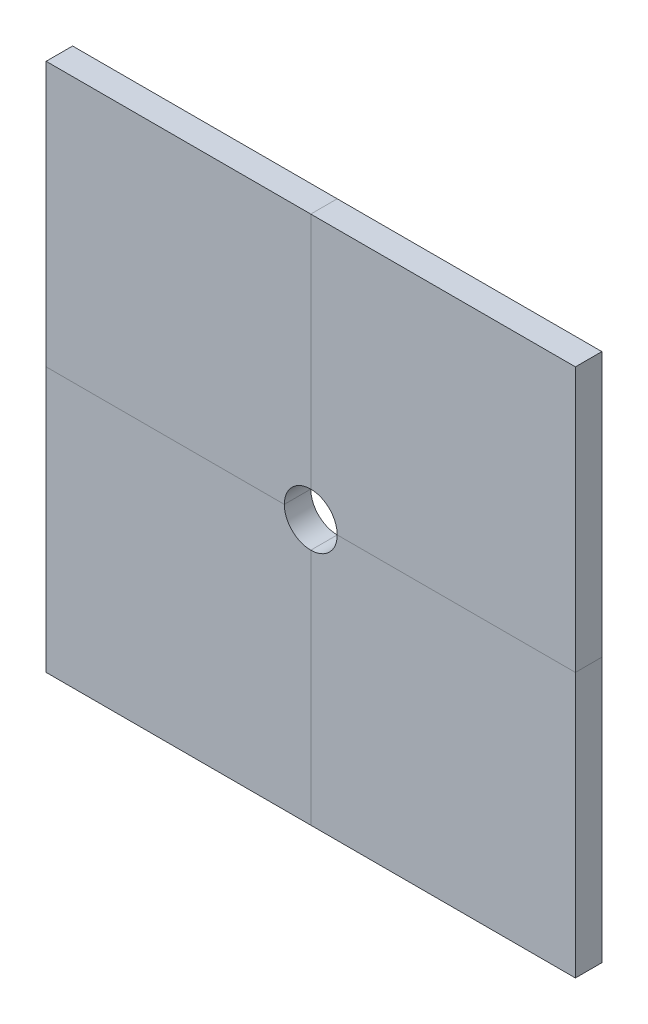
ISO-10303-21;
HEADER;
FILE_DESCRIPTION(('STEP AP214'),'2;1');
FILE_NAME('part.step','',(''),(''),'','','');
FILE_SCHEMA(('AUTOMOTIVE_DESIGN { 1 0 10303 214 1 1 1 1 }'));
ENDSEC;
DATA;
#1=APPLICATION_CONTEXT('core data for automotive mechanical design processes');
#2=APPLICATION_PROTOCOL_DEFINITION('international standard','automotive_design',2000,#1);
#3=PRODUCT_CONTEXT('',#1,'mechanical');
#4=PRODUCT('Part','Part','',(#3));
#5=PRODUCT_RELATED_PRODUCT_CATEGORY('part','',(#4));
#6=PRODUCT_DEFINITION_FORMATION('','',#4);
#7=PRODUCT_DEFINITION_CONTEXT('part definition',#1,'design');
#8=PRODUCT_DEFINITION('design','',#6,#7);
#9=PRODUCT_DEFINITION_SHAPE('','',#8);
#10=(LENGTH_UNIT() NAMED_UNIT(*) SI_UNIT(.MILLI.,.METRE.));
#11=(NAMED_UNIT(*) PLANE_ANGLE_UNIT() SI_UNIT($,.RADIAN.));
#12=(NAMED_UNIT(*) SI_UNIT($,.STERADIAN.) SOLID_ANGLE_UNIT());
#13=UNCERTAINTY_MEASURE_WITH_UNIT(LENGTH_MEASURE(1.E-05),#10,'distance_accuracy_value','');
#14=(GEOMETRIC_REPRESENTATION_CONTEXT(3) GLOBAL_UNCERTAINTY_ASSIGNED_CONTEXT((#13)) GLOBAL_UNIT_ASSIGNED_CONTEXT((#10,
#11,#12)) REPRESENTATION_CONTEXT('',''));
#15=CARTESIAN_POINT('',(0.,0.,0.));
#16=DIRECTION('',(0.,0.,1.));
#17=DIRECTION('',(1.,0.,0.));
#18=AXIS2_PLACEMENT_3D('',#15,#16,#17);
#19=CARTESIAN_POINT('',(-25.4,-177.8,25.4));
#20=DIRECTION('',(0.,0.,-1.));
#21=DIRECTION('',(1.,0.,0.));
#22=AXIS2_PLACEMENT_3D('',#19,#20,#21);
#23=CYLINDRICAL_SURFACE('',#22,25.4000000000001);
#24=CARTESIAN_POINT('',(-25.4,-177.8,0.));
#25=DIRECTION('',(0.,0.,-1.));
#26=DIRECTION('',(1.,0.,0.));
#27=AXIS2_PLACEMENT_3D('',#24,#25,#26);
#28=CIRCLE('',#27,25.4000000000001);
#29=CARTESIAN_POINT('',(-25.4,-203.2,0.));
#30=VERTEX_POINT('',#29);
#31=CARTESIAN_POINT('',(-50.8000000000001,-177.8,0.));
#32=VERTEX_POINT('',#31);
#33=EDGE_CURVE('E128',#30,#32,#28,.T.);
#34=ORIENTED_EDGE('',*,*,#33,.T.);
#35=DIRECTION('',(0.,0.,-1.));
#36=VECTOR('',#35,1.);
#37=CARTESIAN_POINT('',(-50.8000000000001,-177.8,25.4));
#38=LINE('',#37,#36);
#39=CARTESIAN_POINT('',(-50.8000000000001,-177.8,25.4));
#40=VERTEX_POINT('',#39);
#41=EDGE_CURVE('E12',#40,#32,#38,.T.);
#42=ORIENTED_EDGE('',*,*,#41,.F.);
#43=CARTESIAN_POINT('',(-25.4,-177.8,25.4));
#44=DIRECTION('',(0.,0.,-1.));
#45=DIRECTION('',(1.,0.,0.));
#46=AXIS2_PLACEMENT_3D('',#43,#44,#45);
#47=CIRCLE('',#46,25.4000000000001);
#48=CARTESIAN_POINT('',(-25.4,-203.2,25.4));
#49=VERTEX_POINT('',#48);
#50=EDGE_CURVE('E121',#49,#40,#47,.T.);
#51=ORIENTED_EDGE('',*,*,#50,.F.);
#52=DIRECTION('',(0.,0.,-1.));
#53=VECTOR('',#52,1.);
#54=CARTESIAN_POINT('',(-25.4,-203.2,25.4));
#55=LINE('',#54,#53);
#56=EDGE_CURVE('E116',#49,#30,#55,.T.);
#57=ORIENTED_EDGE('',*,*,#56,.T.);
#58=EDGE_LOOP('',(#34,#42,#51,#57));
#59=FACE_BOUND('',#58,.T.);
#60=ADVANCED_FACE('F46',(#59),#23,.F.);
#61=CARTESIAN_POINT('',(-279.4,-177.8,25.4));
#62=DIRECTION('',(0.,-1.,0.));
#63=DIRECTION('',(1.,0.,0.));
#64=AXIS2_PLACEMENT_3D('',#61,#62,#63);
#65=PLANE('',#64);
#66=DIRECTION('',(-1.,0.,0.));
#67=VECTOR('',#66,1.);
#68=CARTESIAN_POINT('',(-279.4,-177.8,0.));
#69=LINE('',#68,#67);
#70=CARTESIAN_POINT('',(-279.4,-177.8,0.));
#71=VERTEX_POINT('',#70);
#72=EDGE_CURVE('E125',#32,#71,#69,.T.);
#73=ORIENTED_EDGE('',*,*,#72,.T.);
#74=DIRECTION('',(0.,0.,-1.));
#75=VECTOR('',#74,1.);
#76=CARTESIAN_POINT('',(-279.4,-177.8,25.4));
#77=LINE('',#76,#75);
#78=CARTESIAN_POINT('',(-279.4,-177.8,25.4));
#79=VERTEX_POINT('',#78);
#80=EDGE_CURVE('E54',#79,#71,#77,.T.);
#81=ORIENTED_EDGE('',*,*,#80,.F.);
#82=DIRECTION('',(-1.,0.,0.));
#83=VECTOR('',#82,1.);
#84=CARTESIAN_POINT('',(-279.4,-177.8,25.4));
#85=LINE('',#84,#83);
#86=EDGE_CURVE('E92',#40,#79,#85,.T.);
#87=ORIENTED_EDGE('',*,*,#86,.F.);
#88=ORIENTED_EDGE('',*,*,#41,.T.);
#89=EDGE_LOOP('',(#73,#81,#87,#88));
#90=FACE_BOUND('',#89,.T.);
#91=ADVANCED_FACE('F136',(#90),#65,.F.);
#92=CARTESIAN_POINT('',(-279.4,-431.8,25.4));
#93=DIRECTION('',(1.,0.,0.));
#94=DIRECTION('',(0.,1.,0.));
#95=AXIS2_PLACEMENT_3D('',#92,#93,#94);
#96=PLANE('',#95);
#97=DIRECTION('',(0.,-1.,0.));
#98=VECTOR('',#97,1.);
#99=CARTESIAN_POINT('',(-279.4,-431.8,0.));
#100=LINE('',#99,#98);
#101=CARTESIAN_POINT('',(-279.4,-431.8,0.));
#102=VERTEX_POINT('',#101);
#103=EDGE_CURVE('E114',#71,#102,#100,.T.);
#104=ORIENTED_EDGE('',*,*,#103,.T.);
#105=DIRECTION('',(0.,0.,-1.));
#106=VECTOR('',#105,1.);
#107=CARTESIAN_POINT('',(-279.4,-431.8,25.4));
#108=LINE('',#107,#106);
#109=CARTESIAN_POINT('',(-279.4,-431.8,25.4));
#110=VERTEX_POINT('',#109);
#111=EDGE_CURVE('E104',#110,#102,#108,.T.);
#112=ORIENTED_EDGE('',*,*,#111,.F.);
#113=DIRECTION('',(0.,-1.,0.));
#114=VECTOR('',#113,1.);
#115=CARTESIAN_POINT('',(-279.4,-431.8,25.4));
#116=LINE('',#115,#114);
#117=EDGE_CURVE('E107',#79,#110,#116,.T.);
#118=ORIENTED_EDGE('',*,*,#117,.F.);
#119=ORIENTED_EDGE('',*,*,#80,.T.);
#120=EDGE_LOOP('',(#104,#112,#118,#119));
#121=FACE_BOUND('',#120,.T.);
#122=ADVANCED_FACE('F113',(#121),#96,.F.);
#123=CARTESIAN_POINT('',(-25.4000000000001,-431.8,25.4));
#124=DIRECTION('',(0.,1.,0.));
#125=DIRECTION('',(0.,0.,-1.));
#126=AXIS2_PLACEMENT_3D('',#123,#124,#125);
#127=PLANE('',#126);
#128=DIRECTION('',(1.,0.,0.));
#129=VECTOR('',#128,1.);
#130=CARTESIAN_POINT('',(-25.4000000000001,-431.8,0.));
#131=LINE('',#130,#129);
#132=CARTESIAN_POINT('',(-25.4000000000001,-431.8,0.));
#133=VERTEX_POINT('',#132);
#134=EDGE_CURVE('E122',#102,#133,#131,.T.);
#135=ORIENTED_EDGE('',*,*,#134,.T.);
#136=DIRECTION('',(0.,0.,-1.));
#137=VECTOR('',#136,1.);
#138=CARTESIAN_POINT('',(-25.4000000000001,-431.8,25.4));
#139=LINE('',#138,#137);
#140=CARTESIAN_POINT('',(-25.4000000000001,-431.8,25.4));
#141=VERTEX_POINT('',#140);
#142=EDGE_CURVE('E106',#141,#133,#139,.T.);
#143=ORIENTED_EDGE('',*,*,#142,.F.);
#144=DIRECTION('',(1.,0.,0.));
#145=VECTOR('',#144,1.);
#146=CARTESIAN_POINT('',(-25.4000000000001,-431.8,25.4));
#147=LINE('',#146,#145);
#148=EDGE_CURVE('E99',#110,#141,#147,.T.);
#149=ORIENTED_EDGE('',*,*,#148,.F.);
#150=ORIENTED_EDGE('',*,*,#111,.T.);
#151=EDGE_LOOP('',(#135,#143,#149,#150));
#152=FACE_BOUND('',#151,.T.);
#153=ADVANCED_FACE('F102',(#152),#127,.F.);
#154=CARTESIAN_POINT('',(-25.4,-203.2,25.4));
#155=DIRECTION('',(-1.,0.,0.));
#156=DIRECTION('',(0.,-1.,0.));
#157=AXIS2_PLACEMENT_3D('',#154,#155,#156);
#158=PLANE('',#157);
#159=DIRECTION('',(0.,1.,0.));
#160=VECTOR('',#159,1.);
#161=CARTESIAN_POINT('',(-25.4,-203.2,0.));
#162=LINE('',#161,#160);
#163=EDGE_CURVE('E81',#133,#30,#162,.T.);
#164=ORIENTED_EDGE('',*,*,#163,.T.);
#165=ORIENTED_EDGE('',*,*,#56,.F.);
#166=DIRECTION('',(0.,1.,0.));
#167=VECTOR('',#166,1.);
#168=CARTESIAN_POINT('',(-25.4,-203.2,25.4));
#169=LINE('',#168,#167);
#170=EDGE_CURVE('E62',#141,#49,#169,.T.);
#171=ORIENTED_EDGE('',*,*,#170,.F.);
#172=ORIENTED_EDGE('',*,*,#142,.T.);
#173=EDGE_LOOP('',(#164,#165,#171,#172));
#174=FACE_BOUND('',#173,.T.);
#175=ADVANCED_FACE('F143',(#174),#158,.F.);
#176=CARTESIAN_POINT('',(-25.4,-177.8,25.4));
#177=DIRECTION('',(0.,0.,-1.));
#178=DIRECTION('',(1.,0.,0.));
#179=AXIS2_PLACEMENT_3D('',#176,#177,#178);
#180=PLANE('',#179);
#181=ORIENTED_EDGE('',*,*,#50,.T.);
#182=ORIENTED_EDGE('',*,*,#86,.T.);
#183=ORIENTED_EDGE('',*,*,#117,.T.);
#184=ORIENTED_EDGE('',*,*,#148,.T.);
#185=ORIENTED_EDGE('',*,*,#170,.T.);
#186=EDGE_LOOP('',(#181,#182,#183,#184,#185));
#187=FACE_BOUND('',#186,.T.);
#188=ADVANCED_FACE('F109',(#187),#180,.F.);
#189=CARTESIAN_POINT('',(-25.4,-177.8,0.));
#190=DIRECTION('',(0.,0.,-1.));
#191=DIRECTION('',(1.,0.,0.));
#192=AXIS2_PLACEMENT_3D('',#189,#190,#191);
#193=PLANE('',#192);
#194=ORIENTED_EDGE('',*,*,#33,.F.);
#195=ORIENTED_EDGE('',*,*,#163,.F.);
#196=ORIENTED_EDGE('',*,*,#134,.F.);
#197=ORIENTED_EDGE('',*,*,#103,.F.);
#198=ORIENTED_EDGE('',*,*,#72,.F.);
#199=EDGE_LOOP('',(#194,#195,#196,#197,#198));
#200=FACE_BOUND('',#199,.T.);
#201=ADVANCED_FACE('F137',(#200),#193,.T.);
#202=CLOSED_SHELL('',(#60,#91,#122,#153,#175,#188,#201));
#203=MANIFOLD_SOLID_BREP('B2',#202);
#204=CARTESIAN_POINT('',(-25.4,-177.8,25.4));
#205=DIRECTION('',(0.,0.,-1.));
#206=DIRECTION('',(-1.,0.,0.));
#207=AXIS2_PLACEMENT_3D('',#204,#205,#206);
#208=CYLINDRICAL_SURFACE('',#207,25.4000000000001);
#209=CARTESIAN_POINT('',(-25.4,-177.8,0.));
#210=DIRECTION('',(0.,0.,1.));
#211=DIRECTION('',(-1.,0.,0.));
#212=AXIS2_PLACEMENT_3D('',#209,#210,#211);
#213=CIRCLE('',#212,25.4000000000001);
#214=CARTESIAN_POINT('',(-25.4,-203.2,0.));
#215=VERTEX_POINT('',#214);
#216=CARTESIAN_POINT('',(0.,-177.8,0.));
#217=VERTEX_POINT('',#216);
#218=EDGE_CURVE('E295',#215,#217,#213,.T.);
#219=ORIENTED_EDGE('',*,*,#218,.F.);
#220=DIRECTION('',(0.,0.,-1.));
#221=VECTOR('',#220,1.);
#222=CARTESIAN_POINT('',(-25.4,-203.2,25.4));
#223=LINE('',#222,#221);
#224=CARTESIAN_POINT('',(-25.4,-203.2,25.4));
#225=VERTEX_POINT('',#224);
#226=EDGE_CURVE('E294',#225,#215,#223,.T.);
#227=ORIENTED_EDGE('',*,*,#226,.F.);
#228=CARTESIAN_POINT('',(-25.4,-177.8,25.4));
#229=DIRECTION('',(0.,0.,1.));
#230=DIRECTION('',(-1.,0.,0.));
#231=AXIS2_PLACEMENT_3D('',#228,#229,#230);
#232=CIRCLE('',#231,25.4000000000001);
#233=CARTESIAN_POINT('',(0.,-177.8,25.4));
#234=VERTEX_POINT('',#233);
#235=EDGE_CURVE('E289',#225,#234,#232,.T.);
#236=ORIENTED_EDGE('',*,*,#235,.T.);
#237=DIRECTION('',(0.,0.,-1.));
#238=VECTOR('',#237,1.);
#239=CARTESIAN_POINT('',(0.,-177.8,25.4));
#240=LINE('',#239,#238);
#241=EDGE_CURVE('E44',#234,#217,#240,.T.);
#242=ORIENTED_EDGE('',*,*,#241,.T.);
#243=EDGE_LOOP('',(#219,#227,#236,#242));
#244=FACE_BOUND('',#243,.T.);
#245=ADVANCED_FACE('F220',(#244),#208,.F.);
#246=CARTESIAN_POINT('',(228.6,-177.8,25.4));
#247=DIRECTION('',(0.,-1.,0.));
#248=DIRECTION('',(-1.,0.,0.));
#249=AXIS2_PLACEMENT_3D('',#246,#247,#248);
#250=PLANE('',#249);
#251=DIRECTION('',(1.,0.,0.));
#252=VECTOR('',#251,1.);
#253=CARTESIAN_POINT('',(228.6,-177.8,0.));
#254=LINE('',#253,#252);
#255=CARTESIAN_POINT('',(228.6,-177.8,0.));
#256=VERTEX_POINT('',#255);
#257=EDGE_CURVE('E297',#217,#256,#254,.T.);
#258=ORIENTED_EDGE('',*,*,#257,.F.);
#259=ORIENTED_EDGE('',*,*,#241,.F.);
#260=DIRECTION('',(1.,0.,0.));
#261=VECTOR('',#260,1.);
#262=CARTESIAN_POINT('',(228.6,-177.8,25.4));
#263=LINE('',#262,#261);
#264=CARTESIAN_POINT('',(228.6,-177.8,25.4));
#265=VERTEX_POINT('',#264);
#266=EDGE_CURVE('E265',#234,#265,#263,.T.);
#267=ORIENTED_EDGE('',*,*,#266,.T.);
#268=DIRECTION('',(0.,0.,-1.));
#269=VECTOR('',#268,1.);
#270=CARTESIAN_POINT('',(228.6,-177.8,25.4));
#271=LINE('',#270,#269);
#272=EDGE_CURVE('E228',#265,#256,#271,.T.);
#273=ORIENTED_EDGE('',*,*,#272,.T.);
#274=EDGE_LOOP('',(#258,#259,#267,#273));
#275=FACE_BOUND('',#274,.T.);
#276=ADVANCED_FACE('F306',(#275),#250,.F.);
#277=CARTESIAN_POINT('',(228.6,-431.8,25.4));
#278=DIRECTION('',(-1.,0.,0.));
#279=DIRECTION('',(0.,1.,0.));
#280=AXIS2_PLACEMENT_3D('',#277,#278,#279);
#281=PLANE('',#280);
#282=DIRECTION('',(0.,-1.,0.));
#283=VECTOR('',#282,1.);
#284=CARTESIAN_POINT('',(228.6,-431.8,0.));
#285=LINE('',#284,#283);
#286=CARTESIAN_POINT('',(228.6,-431.8,0.));
#287=VERTEX_POINT('',#286);
#288=EDGE_CURVE('E300',#256,#287,#285,.T.);
#289=ORIENTED_EDGE('',*,*,#288,.F.);
#290=ORIENTED_EDGE('',*,*,#272,.F.);
#291=DIRECTION('',(0.,-1.,0.));
#292=VECTOR('',#291,1.);
#293=CARTESIAN_POINT('',(228.6,-431.8,25.4));
#294=LINE('',#293,#292);
#295=CARTESIAN_POINT('',(228.6,-431.8,25.4));
#296=VERTEX_POINT('',#295);
#297=EDGE_CURVE('E274',#265,#296,#294,.T.);
#298=ORIENTED_EDGE('',*,*,#297,.T.);
#299=DIRECTION('',(0.,0.,-1.));
#300=VECTOR('',#299,1.);
#301=CARTESIAN_POINT('',(228.6,-431.8,25.4));
#302=LINE('',#301,#300);
#303=EDGE_CURVE('E279',#296,#287,#302,.T.);
#304=ORIENTED_EDGE('',*,*,#303,.T.);
#305=EDGE_LOOP('',(#289,#290,#298,#304));
#306=FACE_BOUND('',#305,.T.);
#307=ADVANCED_FACE('F286',(#306),#281,.F.);
#308=CARTESIAN_POINT('',(-25.4000000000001,-431.8,25.4));
#309=DIRECTION('',(0.,1.,0.));
#310=DIRECTION('',(0.,0.,-1.));
#311=AXIS2_PLACEMENT_3D('',#308,#309,#310);
#312=PLANE('',#311);
#313=DIRECTION('',(-1.,0.,0.));
#314=VECTOR('',#313,1.);
#315=CARTESIAN_POINT('',(-25.4000000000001,-431.8,0.));
#316=LINE('',#315,#314);
#317=CARTESIAN_POINT('',(-25.4000000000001,-431.8,0.));
#318=VERTEX_POINT('',#317);
#319=EDGE_CURVE('E281',#287,#318,#316,.T.);
#320=ORIENTED_EDGE('',*,*,#319,.F.);
#321=ORIENTED_EDGE('',*,*,#303,.F.);
#322=DIRECTION('',(-1.,0.,0.));
#323=VECTOR('',#322,1.);
#324=CARTESIAN_POINT('',(-25.4000000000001,-431.8,25.4));
#325=LINE('',#324,#323);
#326=CARTESIAN_POINT('',(-25.4000000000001,-431.8,25.4));
#327=VERTEX_POINT('',#326);
#328=EDGE_CURVE('E270',#296,#327,#325,.T.);
#329=ORIENTED_EDGE('',*,*,#328,.T.);
#330=DIRECTION('',(0.,0.,-1.));
#331=VECTOR('',#330,1.);
#332=CARTESIAN_POINT('',(-25.4000000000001,-431.8,25.4));
#333=LINE('',#332,#331);
#334=EDGE_CURVE('E284',#327,#318,#333,.T.);
#335=ORIENTED_EDGE('',*,*,#334,.T.);
#336=EDGE_LOOP('',(#320,#321,#329,#335));
#337=FACE_BOUND('',#336,.T.);
#338=ADVANCED_FACE('F280',(#337),#312,.F.);
#339=CARTESIAN_POINT('',(-25.4,-203.2,25.4));
#340=DIRECTION('',(1.,0.,0.));
#341=DIRECTION('',(0.,-1.,0.));
#342=AXIS2_PLACEMENT_3D('',#339,#340,#341);
#343=PLANE('',#342);
#344=DIRECTION('',(0.,1.,0.));
#345=VECTOR('',#344,1.);
#346=CARTESIAN_POINT('',(-25.4,-203.2,0.));
#347=LINE('',#346,#345);
#348=EDGE_CURVE('E253',#318,#215,#347,.T.);
#349=ORIENTED_EDGE('',*,*,#348,.F.);
#350=ORIENTED_EDGE('',*,*,#334,.F.);
#351=DIRECTION('',(0.,1.,0.));
#352=VECTOR('',#351,1.);
#353=CARTESIAN_POINT('',(-25.4,-203.2,25.4));
#354=LINE('',#353,#352);
#355=EDGE_CURVE('E236',#327,#225,#354,.T.);
#356=ORIENTED_EDGE('',*,*,#355,.T.);
#357=ORIENTED_EDGE('',*,*,#226,.T.);
#358=EDGE_LOOP('',(#349,#350,#356,#357));
#359=FACE_BOUND('',#358,.T.);
#360=ADVANCED_FACE('F312',(#359),#343,.F.);
#361=CARTESIAN_POINT('',(-25.4,-177.8,25.4));
#362=DIRECTION('',(0.,0.,-1.));
#363=DIRECTION('',(-1.,0.,0.));
#364=AXIS2_PLACEMENT_3D('',#361,#362,#363);
#365=PLANE('',#364);
#366=ORIENTED_EDGE('',*,*,#235,.F.);
#367=ORIENTED_EDGE('',*,*,#355,.F.);
#368=ORIENTED_EDGE('',*,*,#328,.F.);
#369=ORIENTED_EDGE('',*,*,#297,.F.);
#370=ORIENTED_EDGE('',*,*,#266,.F.);
#371=EDGE_LOOP('',(#366,#367,#368,#369,#370));
#372=FACE_BOUND('',#371,.T.);
#373=ADVANCED_FACE('F272',(#372),#365,.F.);
#374=CARTESIAN_POINT('',(-25.4,-177.8,0.));
#375=DIRECTION('',(0.,0.,-1.));
#376=DIRECTION('',(-1.,0.,0.));
#377=AXIS2_PLACEMENT_3D('',#374,#375,#376);
#378=PLANE('',#377);
#379=ORIENTED_EDGE('',*,*,#218,.T.);
#380=ORIENTED_EDGE('',*,*,#257,.T.);
#381=ORIENTED_EDGE('',*,*,#288,.T.);
#382=ORIENTED_EDGE('',*,*,#319,.T.);
#383=ORIENTED_EDGE('',*,*,#348,.T.);
#384=EDGE_LOOP('',(#379,#380,#381,#382,#383));
#385=FACE_BOUND('',#384,.T.);
#386=ADVANCED_FACE('F307',(#385),#378,.T.);
#387=CLOSED_SHELL('',(#245,#276,#307,#338,#360,#373,#386));
#388=MANIFOLD_SOLID_BREP('B6',#387);
#389=CARTESIAN_POINT('',(-25.4,-177.8,25.4));
#390=DIRECTION('',(0.,0.,-1.));
#391=DIRECTION('',(1.,0.,0.));
#392=AXIS2_PLACEMENT_3D('',#389,#390,#391);
#393=CYLINDRICAL_SURFACE('',#392,25.4000000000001);
#394=CARTESIAN_POINT('',(-25.4,-177.8,0.));
#395=DIRECTION('',(0.,0.,1.));
#396=DIRECTION('',(1.,0.,0.));
#397=AXIS2_PLACEMENT_3D('',#394,#395,#396);
#398=CIRCLE('',#397,25.4000000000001);
#399=CARTESIAN_POINT('',(-25.4,-152.4,0.));
#400=VERTEX_POINT('',#399);
#401=CARTESIAN_POINT('',(-50.8000000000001,-177.8,0.));
#402=VERTEX_POINT('',#401);
#403=EDGE_CURVE('E468',#400,#402,#398,.T.);
#404=ORIENTED_EDGE('',*,*,#403,.F.);
#405=DIRECTION('',(0.,0.,-1.));
#406=VECTOR('',#405,1.);
#407=CARTESIAN_POINT('',(-25.4,-152.4,25.4));
#408=LINE('',#407,#406);
#409=CARTESIAN_POINT('',(-25.4,-152.4,25.4));
#410=VERTEX_POINT('',#409);
#411=EDGE_CURVE('E467',#410,#400,#408,.T.);
#412=ORIENTED_EDGE('',*,*,#411,.F.);
#413=CARTESIAN_POINT('',(-25.4,-177.8,25.4));
#414=DIRECTION('',(0.,0.,1.));
#415=DIRECTION('',(1.,0.,0.));
#416=AXIS2_PLACEMENT_3D('',#413,#414,#415);
#417=CIRCLE('',#416,25.4000000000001);
#418=CARTESIAN_POINT('',(-50.8000000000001,-177.8,25.4));
#419=VERTEX_POINT('',#418);
#420=EDGE_CURVE('E462',#410,#419,#417,.T.);
#421=ORIENTED_EDGE('',*,*,#420,.T.);
#422=DIRECTION('',(0.,0.,-1.));
#423=VECTOR('',#422,1.);
#424=CARTESIAN_POINT('',(-50.8000000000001,-177.8,25.4));
#425=LINE('',#424,#423);
#426=EDGE_CURVE('E218',#419,#402,#425,.T.);
#427=ORIENTED_EDGE('',*,*,#426,.T.);
#428=EDGE_LOOP('',(#404,#412,#421,#427));
#429=FACE_BOUND('',#428,.T.);
#430=ADVANCED_FACE('F393',(#429),#393,.F.);
#431=CARTESIAN_POINT('',(-279.4,-177.8,25.4));
#432=DIRECTION('',(0.,1.,0.));
#433=DIRECTION('',(1.,0.,0.));
#434=AXIS2_PLACEMENT_3D('',#431,#432,#433);
#435=PLANE('',#434);
#436=DIRECTION('',(-1.,0.,0.));
#437=VECTOR('',#436,1.);
#438=CARTESIAN_POINT('',(-279.4,-177.8,0.));
#439=LINE('',#438,#437);
#440=CARTESIAN_POINT('',(-279.4,-177.8,0.));
#441=VERTEX_POINT('',#440);
#442=EDGE_CURVE('E470',#402,#441,#439,.T.);
#443=ORIENTED_EDGE('',*,*,#442,.F.);
#444=ORIENTED_EDGE('',*,*,#426,.F.);
#445=DIRECTION('',(-1.,0.,0.));
#446=VECTOR('',#445,1.);
#447=CARTESIAN_POINT('',(-279.4,-177.8,25.4));
#448=LINE('',#447,#446);
#449=CARTESIAN_POINT('',(-279.4,-177.8,25.4));
#450=VERTEX_POINT('',#449);
#451=EDGE_CURVE('E438',#419,#450,#448,.T.);
#452=ORIENTED_EDGE('',*,*,#451,.T.);
#453=DIRECTION('',(0.,0.,-1.));
#454=VECTOR('',#453,1.);
#455=CARTESIAN_POINT('',(-279.4,-177.8,25.4));
#456=LINE('',#455,#454);
#457=EDGE_CURVE('E401',#450,#441,#456,.T.);
#458=ORIENTED_EDGE('',*,*,#457,.T.);
#459=EDGE_LOOP('',(#443,#444,#452,#458));
#460=FACE_BOUND('',#459,.T.);
#461=ADVANCED_FACE('F479',(#460),#435,.F.);
#462=CARTESIAN_POINT('',(-279.4,76.2,25.4));
#463=DIRECTION('',(1.,0.,0.));
#464=DIRECTION('',(0.,-1.,0.));
#465=AXIS2_PLACEMENT_3D('',#462,#463,#464);
#466=PLANE('',#465);
#467=DIRECTION('',(0.,1.,0.));
#468=VECTOR('',#467,1.);
#469=CARTESIAN_POINT('',(-279.4,76.2,0.));
#470=LINE('',#469,#468);
#471=CARTESIAN_POINT('',(-279.4,76.2,0.));
#472=VERTEX_POINT('',#471);
#473=EDGE_CURVE('E473',#441,#472,#470,.T.);
#474=ORIENTED_EDGE('',*,*,#473,.F.);
#475=ORIENTED_EDGE('',*,*,#457,.F.);
#476=DIRECTION('',(0.,1.,0.));
#477=VECTOR('',#476,1.);
#478=CARTESIAN_POINT('',(-279.4,76.2,25.4));
#479=LINE('',#478,#477);
#480=CARTESIAN_POINT('',(-279.4,76.2,25.4));
#481=VERTEX_POINT('',#480);
#482=EDGE_CURVE('E447',#450,#481,#479,.T.);
#483=ORIENTED_EDGE('',*,*,#482,.T.);
#484=DIRECTION('',(0.,0.,-1.));
#485=VECTOR('',#484,1.);
#486=CARTESIAN_POINT('',(-279.4,76.2,25.4));
#487=LINE('',#486,#485);
#488=EDGE_CURVE('E452',#481,#472,#487,.T.);
#489=ORIENTED_EDGE('',*,*,#488,.T.);
#490=EDGE_LOOP('',(#474,#475,#483,#489));
#491=FACE_BOUND('',#490,.T.);
#492=ADVANCED_FACE('F459',(#491),#466,.F.);
#493=CARTESIAN_POINT('',(-25.4,76.2,25.4));
#494=DIRECTION('',(0.,-1.,0.));
#495=DIRECTION('',(0.,0.,-1.));
#496=AXIS2_PLACEMENT_3D('',#493,#494,#495);
#497=PLANE('',#496);
#498=DIRECTION('',(1.,0.,0.));
#499=VECTOR('',#498,1.);
#500=CARTESIAN_POINT('',(-25.4,76.2,0.));
#501=LINE('',#500,#499);
#502=CARTESIAN_POINT('',(-25.4,76.2,0.));
#503=VERTEX_POINT('',#502);
#504=EDGE_CURVE('E454',#472,#503,#501,.T.);
#505=ORIENTED_EDGE('',*,*,#504,.F.);
#506=ORIENTED_EDGE('',*,*,#488,.F.);
#507=DIRECTION('',(1.,0.,0.));
#508=VECTOR('',#507,1.);
#509=CARTESIAN_POINT('',(-25.4,76.2,25.4));
#510=LINE('',#509,#508);
#511=CARTESIAN_POINT('',(-25.4,76.2,25.4));
#512=VERTEX_POINT('',#511);
#513=EDGE_CURVE('E443',#481,#512,#510,.T.);
#514=ORIENTED_EDGE('',*,*,#513,.T.);
#515=DIRECTION('',(0.,0.,-1.));
#516=VECTOR('',#515,1.);
#517=CARTESIAN_POINT('',(-25.4,76.2,25.4));
#518=LINE('',#517,#516);
#519=EDGE_CURVE('E457',#512,#503,#518,.T.);
#520=ORIENTED_EDGE('',*,*,#519,.T.);
#521=EDGE_LOOP('',(#505,#506,#514,#520));
#522=FACE_BOUND('',#521,.T.);
#523=ADVANCED_FACE('F453',(#522),#497,.F.);
#524=CARTESIAN_POINT('',(-25.4,-152.4,25.4));
#525=DIRECTION('',(-1.,0.,0.));
#526=DIRECTION('',(0.,1.,0.));
#527=AXIS2_PLACEMENT_3D('',#524,#525,#526);
#528=PLANE('',#527);
#529=DIRECTION('',(0.,-1.,0.));
#530=VECTOR('',#529,1.);
#531=CARTESIAN_POINT('',(-25.4,-152.4,0.));
#532=LINE('',#531,#530);
#533=EDGE_CURVE('E426',#503,#400,#532,.T.);
#534=ORIENTED_EDGE('',*,*,#533,.F.);
#535=ORIENTED_EDGE('',*,*,#519,.F.);
#536=DIRECTION('',(0.,-1.,0.));
#537=VECTOR('',#536,1.);
#538=CARTESIAN_POINT('',(-25.4,-152.4,25.4));
#539=LINE('',#538,#537);
#540=EDGE_CURVE('E409',#512,#410,#539,.T.);
#541=ORIENTED_EDGE('',*,*,#540,.T.);
#542=ORIENTED_EDGE('',*,*,#411,.T.);
#543=EDGE_LOOP('',(#534,#535,#541,#542));
#544=FACE_BOUND('',#543,.T.);
#545=ADVANCED_FACE('F485',(#544),#528,.F.);
#546=CARTESIAN_POINT('',(-25.4,-177.8,25.4));
#547=DIRECTION('',(0.,0.,-1.));
#548=DIRECTION('',(1.,0.,0.));
#549=AXIS2_PLACEMENT_3D('',#546,#547,#548);
#550=PLANE('',#549);
#551=ORIENTED_EDGE('',*,*,#420,.F.);
#552=ORIENTED_EDGE('',*,*,#540,.F.);
#553=ORIENTED_EDGE('',*,*,#513,.F.);
#554=ORIENTED_EDGE('',*,*,#482,.F.);
#555=ORIENTED_EDGE('',*,*,#451,.F.);
#556=EDGE_LOOP('',(#551,#552,#553,#554,#555));
#557=FACE_BOUND('',#556,.T.);
#558=ADVANCED_FACE('F445',(#557),#550,.F.);
#559=CARTESIAN_POINT('',(-25.4,-177.8,0.));
#560=DIRECTION('',(0.,0.,-1.));
#561=DIRECTION('',(1.,0.,0.));
#562=AXIS2_PLACEMENT_3D('',#559,#560,#561);
#563=PLANE('',#562);
#564=ORIENTED_EDGE('',*,*,#403,.T.);
#565=ORIENTED_EDGE('',*,*,#442,.T.);
#566=ORIENTED_EDGE('',*,*,#473,.T.);
#567=ORIENTED_EDGE('',*,*,#504,.T.);
#568=ORIENTED_EDGE('',*,*,#533,.T.);
#569=EDGE_LOOP('',(#564,#565,#566,#567,#568));
#570=FACE_BOUND('',#569,.T.);
#571=ADVANCED_FACE('F480',(#570),#563,.T.);
#572=CLOSED_SHELL('',(#430,#461,#492,#523,#545,#558,#571));
#573=MANIFOLD_SOLID_BREP('B38',#572);
#574=CARTESIAN_POINT('',(-25.4,-177.8,25.4));
#575=DIRECTION('',(0.,0.,-1.));
#576=DIRECTION('',(-1.,0.,0.));
#577=AXIS2_PLACEMENT_3D('',#574,#575,#576);
#578=CYLINDRICAL_SURFACE('',#577,25.4000000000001);
#579=CARTESIAN_POINT('',(-25.4,-177.8,0.));
#580=DIRECTION('',(0.,0.,-1.));
#581=DIRECTION('',(-1.,0.,0.));
#582=AXIS2_PLACEMENT_3D('',#579,#580,#581);
#583=CIRCLE('',#582,25.4000000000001);
#584=CARTESIAN_POINT('',(-25.4,-152.4,0.));
#585=VERTEX_POINT('',#584);
#586=CARTESIAN_POINT('',(0.,-177.8,0.));
#587=VERTEX_POINT('',#586);
#588=EDGE_CURVE('E631',#585,#587,#583,.T.);
#589=ORIENTED_EDGE('',*,*,#588,.T.);
#590=DIRECTION('',(0.,0.,-1.));
#591=VECTOR('',#590,1.);
#592=CARTESIAN_POINT('',(0.,-177.8,25.4));
#593=LINE('',#592,#591);
#594=CARTESIAN_POINT('',(0.,-177.8,25.4));
#595=VERTEX_POINT('',#594);
#596=EDGE_CURVE('E391',#595,#587,#593,.T.);
#597=ORIENTED_EDGE('',*,*,#596,.F.);
#598=CARTESIAN_POINT('',(-25.4,-177.8,25.4));
#599=DIRECTION('',(0.,0.,-1.));
#600=DIRECTION('',(-1.,0.,0.));
#601=AXIS2_PLACEMENT_3D('',#598,#599,#600);
#602=CIRCLE('',#601,25.4000000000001);
#603=CARTESIAN_POINT('',(-25.4,-152.4,25.4));
#604=VERTEX_POINT('',#603);
#605=EDGE_CURVE('E639',#604,#595,#602,.T.);
#606=ORIENTED_EDGE('',*,*,#605,.F.);
#607=DIRECTION('',(0.,0.,-1.));
#608=VECTOR('',#607,1.);
#609=CARTESIAN_POINT('',(-25.4,-152.4,25.4));
#610=LINE('',#609,#608);
#611=EDGE_CURVE('E627',#604,#585,#610,.T.);
#612=ORIENTED_EDGE('',*,*,#611,.T.);
#613=EDGE_LOOP('',(#589,#597,#606,#612));
#614=FACE_BOUND('',#613,.T.);
#615=ADVANCED_FACE('F557',(#614),#578,.F.);
#616=CARTESIAN_POINT('',(228.6,-177.8,25.4));
#617=DIRECTION('',(0.,1.,0.));
#618=DIRECTION('',(-1.,0.,0.));
#619=AXIS2_PLACEMENT_3D('',#616,#617,#618);
#620=PLANE('',#619);
#621=DIRECTION('',(1.,0.,0.));
#622=VECTOR('',#621,1.);
#623=CARTESIAN_POINT('',(228.6,-177.8,0.));
#624=LINE('',#623,#622);
#625=CARTESIAN_POINT('',(228.6,-177.8,0.));
#626=VERTEX_POINT('',#625);
#627=EDGE_CURVE('E634',#587,#626,#624,.T.);
#628=ORIENTED_EDGE('',*,*,#627,.T.);
#629=DIRECTION('',(0.,0.,-1.));
#630=VECTOR('',#629,1.);
#631=CARTESIAN_POINT('',(228.6,-177.8,25.4));
#632=LINE('',#631,#630);
#633=CARTESIAN_POINT('',(228.6,-177.8,25.4));
#634=VERTEX_POINT('',#633);
#635=EDGE_CURVE('E565',#634,#626,#632,.T.);
#636=ORIENTED_EDGE('',*,*,#635,.F.);
#637=DIRECTION('',(1.,0.,0.));
#638=VECTOR('',#637,1.);
#639=CARTESIAN_POINT('',(228.6,-177.8,25.4));
#640=LINE('',#639,#638);
#641=EDGE_CURVE('E607',#595,#634,#640,.T.);
#642=ORIENTED_EDGE('',*,*,#641,.F.);
#643=ORIENTED_EDGE('',*,*,#596,.T.);
#644=EDGE_LOOP('',(#628,#636,#642,#643));
#645=FACE_BOUND('',#644,.T.);
#646=ADVANCED_FACE('F658',(#645),#620,.F.);
#647=CARTESIAN_POINT('',(228.6,76.2,25.4));
#648=DIRECTION('',(-1.,0.,0.));
#649=DIRECTION('',(0.,-1.,0.));
#650=AXIS2_PLACEMENT_3D('',#647,#648,#649);
#651=PLANE('',#650);
#652=DIRECTION('',(0.,1.,0.));
#653=VECTOR('',#652,1.);
#654=CARTESIAN_POINT('',(228.6,76.2,0.));
#655=LINE('',#654,#653);
#656=CARTESIAN_POINT('',(228.6,76.2,0.));
#657=VERTEX_POINT('',#656);
#658=EDGE_CURVE('E622',#626,#657,#655,.T.);
#659=ORIENTED_EDGE('',*,*,#658,.T.);
#660=DIRECTION('',(0.,0.,-1.));
#661=VECTOR('',#660,1.);
#662=CARTESIAN_POINT('',(228.6,76.2,25.4));
#663=LINE('',#662,#661);
#664=CARTESIAN_POINT('',(228.6,76.2,25.4));
#665=VERTEX_POINT('',#664);
#666=EDGE_CURVE('E619',#665,#657,#663,.T.);
#667=ORIENTED_EDGE('',*,*,#666,.F.);
#668=DIRECTION('',(0.,1.,0.));
#669=VECTOR('',#668,1.);
#670=CARTESIAN_POINT('',(228.6,76.2,25.4));
#671=LINE('',#670,#669);
#672=EDGE_CURVE('E611',#634,#665,#671,.T.);
#673=ORIENTED_EDGE('',*,*,#672,.F.);
#674=ORIENTED_EDGE('',*,*,#635,.T.);
#675=EDGE_LOOP('',(#659,#667,#673,#674));
#676=FACE_BOUND('',#675,.T.);
#677=ADVANCED_FACE('F620',(#676),#651,.F.);
#678=CARTESIAN_POINT('',(-25.4,76.2,25.4));
#679=DIRECTION('',(0.,-1.,0.));
#680=DIRECTION('',(0.,0.,-1.));
#681=AXIS2_PLACEMENT_3D('',#678,#679,#680);
#682=PLANE('',#681);
#683=DIRECTION('',(-1.,0.,0.));
#684=VECTOR('',#683,1.);
#685=CARTESIAN_POINT('',(-25.4,76.2,0.));
#686=LINE('',#685,#684);
#687=CARTESIAN_POINT('',(-25.4,76.2,0.));
#688=VERTEX_POINT('',#687);
#689=EDGE_CURVE('E593',#657,#688,#686,.T.);
#690=ORIENTED_EDGE('',*,*,#689,.T.);
#691=DIRECTION('',(0.,0.,-1.));
#692=VECTOR('',#691,1.);
#693=CARTESIAN_POINT('',(-25.4,76.2,25.4));
#694=LINE('',#693,#692);
#695=CARTESIAN_POINT('',(-25.4,76.2,25.4));
#696=VERTEX_POINT('',#695);
#697=EDGE_CURVE('E623',#696,#688,#694,.T.);
#698=ORIENTED_EDGE('',*,*,#697,.F.);
#699=DIRECTION('',(-1.,0.,0.));
#700=VECTOR('',#699,1.);
#701=CARTESIAN_POINT('',(-25.4,76.2,25.4));
#702=LINE('',#701,#700);
#703=EDGE_CURVE('E615',#665,#696,#702,.T.);
#704=ORIENTED_EDGE('',*,*,#703,.F.);
#705=ORIENTED_EDGE('',*,*,#666,.T.);
#706=EDGE_LOOP('',(#690,#698,#704,#705));
#707=FACE_BOUND('',#706,.T.);
#708=ADVANCED_FACE('F625',(#707),#682,.F.);
#709=CARTESIAN_POINT('',(-25.4,-152.4,25.4));
#710=DIRECTION('',(1.,0.,0.));
#711=DIRECTION('',(0.,1.,0.));
#712=AXIS2_PLACEMENT_3D('',#709,#710,#711);
#713=PLANE('',#712);
#714=DIRECTION('',(0.,-1.,0.));
#715=VECTOR('',#714,1.);
#716=CARTESIAN_POINT('',(-25.4,-152.4,0.));
#717=LINE('',#716,#715);
#718=EDGE_CURVE('E599',#688,#585,#717,.T.);
#719=ORIENTED_EDGE('',*,*,#718,.T.);
#720=ORIENTED_EDGE('',*,*,#611,.F.);
#721=DIRECTION('',(0.,-1.,0.));
#722=VECTOR('',#721,1.);
#723=CARTESIAN_POINT('',(-25.4,-152.4,25.4));
#724=LINE('',#723,#722);
#725=EDGE_CURVE('E573',#696,#604,#724,.T.);
#726=ORIENTED_EDGE('',*,*,#725,.F.);
#727=ORIENTED_EDGE('',*,*,#697,.T.);
#728=EDGE_LOOP('',(#719,#720,#726,#727));
#729=FACE_BOUND('',#728,.T.);
#730=ADVANCED_FACE('F647',(#729),#713,.F.);
#731=CARTESIAN_POINT('',(-25.4,-177.8,25.4));
#732=DIRECTION('',(0.,0.,-1.));
#733=DIRECTION('',(-1.,0.,0.));
#734=AXIS2_PLACEMENT_3D('',#731,#732,#733);
#735=PLANE('',#734);
#736=ORIENTED_EDGE('',*,*,#605,.T.);
#737=ORIENTED_EDGE('',*,*,#641,.T.);
#738=ORIENTED_EDGE('',*,*,#672,.T.);
#739=ORIENTED_EDGE('',*,*,#703,.T.);
#740=ORIENTED_EDGE('',*,*,#725,.T.);
#741=EDGE_LOOP('',(#736,#737,#738,#739,#740));
#742=FACE_BOUND('',#741,.T.);
#743=ADVANCED_FACE('F613',(#742),#735,.F.);
#744=CARTESIAN_POINT('',(-25.4,-177.8,0.));
#745=DIRECTION('',(0.,0.,-1.));
#746=DIRECTION('',(-1.,0.,0.));
#747=AXIS2_PLACEMENT_3D('',#744,#745,#746);
#748=PLANE('',#747);
#749=ORIENTED_EDGE('',*,*,#588,.F.);
#750=ORIENTED_EDGE('',*,*,#718,.F.);
#751=ORIENTED_EDGE('',*,*,#689,.F.);
#752=ORIENTED_EDGE('',*,*,#658,.F.);
#753=ORIENTED_EDGE('',*,*,#627,.F.);
#754=EDGE_LOOP('',(#749,#750,#751,#752,#753));
#755=FACE_BOUND('',#754,.T.);
#756=ADVANCED_FACE('F643',(#755),#748,.T.);
#757=CLOSED_SHELL('',(#615,#646,#677,#708,#730,#743,#756));
#758=MANIFOLD_SOLID_BREP('B212',#757);
#759=ADVANCED_BREP_SHAPE_REPRESENTATION('',(#18,#203,#388,#573,#758),#14);
#760=SHAPE_DEFINITION_REPRESENTATION(#9,#759);
ENDSEC;
END-ISO-10303-21;
